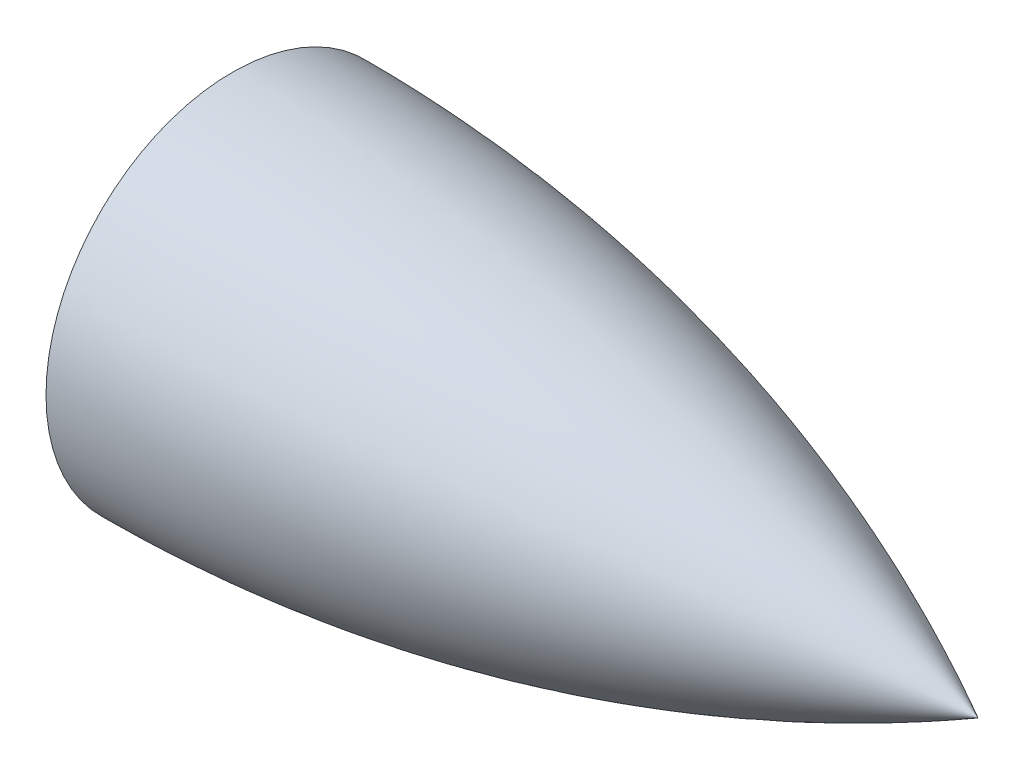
from build123d import *


with BuildPart() as part:
    # Tangent Ogive Profile → Tangent Ogive (revolve)
    with BuildSketch(Plane.XY):
        with BuildLine():
            Line((0, 0), (304.8, 0))
            ThreePointArc((304.8, 0), (157.090324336, 56.861297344), (0, 76.2))
            Line((0, 76.2), (0, 0))
        make_face()
    revolve(axis=Axis((0, 0, 0), (1, 0, 0)))


solid = part.part
